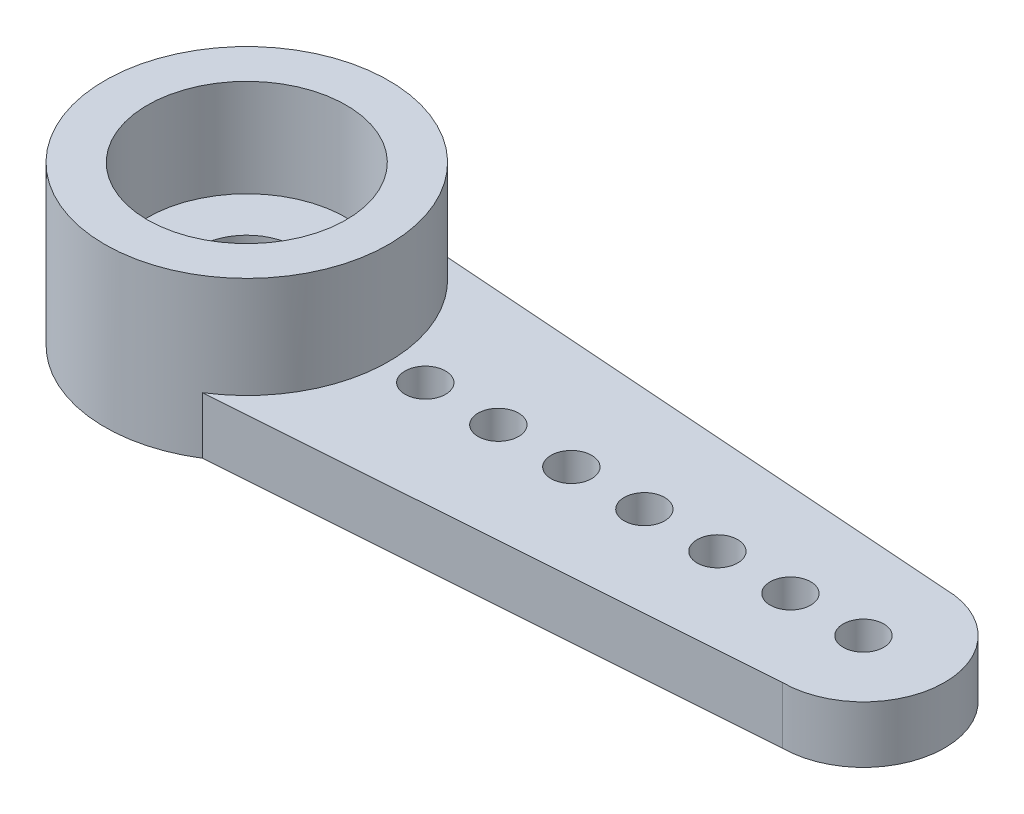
from build123d import *

# Parameters (mm, degrees)
SKETCH1_R           = 0.5
BOSS_EXTRUDE1_DEPTH = 1.4
SKETCH2_R           = 2.35
CUT_EXTRUDE1_DEPTH  = 1
SKETCH3_R           = 3.5
SKETCH3_R_2         = 2.45
BOSS_EXTRUDE2_DEPTH = 2.5
SKETCH4_R           = 1.2
CUT_EXTRUDE2_DEPTH  = 20.282440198
SKETCH5_R           = 2.45
SKETCH5_R_2         = 1.2
BOSS_EXTRUDE3_DEPTH = 0.1
SKETCH6_W           = 35.735260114
SKETCH6_H           = 17.672039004
CUT_EXTRUDE4_DEPTH  = 20.513392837
CUT_EXTRUDE5_DEPTH  = 18.980545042


with BuildPart() as part:
    # Sketch1 → Boss-Extrude1 (new body)
    with BuildSketch(Plane(origin=(0, 0, 0), x_dir=(1, 0, 0), z_dir=(0, 1, 0))):
        with BuildLine():
            Line((-15.2, 2), (-2, 2.95))
            Line((-2, 2.95), (-2, 6.35))
            ThreePointArc((-2, 6.35), (0, 8.35), (2, 6.35))
            Line((2, 6.35), (2, 3.5))
            Line((2, 3.5), (15.2, 2))
            ThreePointArc((15.2, 2), (17.2, 0), (15.2, -2))
            Line((15.2, -2), (2, -3.5))
            Line((2, -3.5), (2, -6.35))
            ThreePointArc((2, -6.35), (0, -8.35), (-2, -6.35))
            Line((-2, -6.35), (-2, -2.95))
            Line((-2, -2.95), (-15.2, -2))
            ThreePointArc((-15.2, -2), (-17.2, 0), (-15.2, 2))
        make_face()
        with Locations((0, 6.35)):
            Circle(SKETCH1_R, mode=Mode.SUBTRACT)
        with Locations((0, 4.55)):
            Circle(SKETCH1_R, mode=Mode.SUBTRACT)
        with Locations((0, -4.55)):
            Circle(SKETCH1_R, mode=Mode.SUBTRACT)
        with Locations((0, -6.35)):
            Circle(SKETCH1_R, mode=Mode.SUBTRACT)
        with Locations((-15.2, 0)):
            Circle(SKETCH1_R, mode=Mode.SUBTRACT)
        with Locations(Location((15.2, 0, 0), (0, 0, 270))):
            Circle(SKETCH1_R, mode=Mode.SUBTRACT)
        with Locations((-13.4, 0)):
            Circle(SKETCH1_R, mode=Mode.SUBTRACT)
        with Locations((-11.6, 0)):
            Circle(SKETCH1_R, mode=Mode.SUBTRACT)
        with Locations((-9.8, 0)):
            Circle(SKETCH1_R, mode=Mode.SUBTRACT)
        with Locations((-8, 0)):
            Circle(SKETCH1_R, mode=Mode.SUBTRACT)
        with Locations((-6.2, 0)):
            Circle(SKETCH1_R, mode=Mode.SUBTRACT)
        with Locations((-4.4, 0)):
            Circle(SKETCH1_R, mode=Mode.SUBTRACT)
        with Locations(Location((13.4, 0, 0), (0, 0, 270))):
            Circle(SKETCH1_R, mode=Mode.SUBTRACT)
        with Locations(Location((11.6, 0, 0), (0, 0, 270))):
            Circle(SKETCH1_R, mode=Mode.SUBTRACT)
        with Locations(Location((9.8, 0, 0), (0, 0, 270))):
            Circle(SKETCH1_R, mode=Mode.SUBTRACT)
        with Locations(Location((8, 0, 0), (0, 0, 270))):
            Circle(SKETCH1_R, mode=Mode.SUBTRACT)
        with Locations(Location((6.2, 0, 0), (0, 0, 270))):
            Circle(SKETCH1_R, mode=Mode.SUBTRACT)
        with Locations(Location((4.4, 0, 0), (0, 0, 270))):
            Circle(SKETCH1_R, mode=Mode.SUBTRACT)
    extrude(amount=BOSS_EXTRUDE1_DEPTH)

    # Sketch2 → Cut-Extrude1 (cut)
    with BuildSketch(Plane.XZ):
        with Locations(Location((0, 0, 0), (0, 0, 270))):
            Circle(SKETCH2_R)
    extrude(amount=-CUT_EXTRUDE1_DEPTH, mode=Mode.SUBTRACT)

    # Sketch3 → Boss-Extrude2 (add)
    with BuildSketch(Plane(origin=(0, 1.4, 0), x_dir=(1, 0, 0), z_dir=(0, 1, 0))):
        with Locations(Location((0, 0, 0), (0, 0, 57.731921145))):
            Circle(SKETCH3_R)
        with Locations(Location((0, 0, 0), (0, 0, 270))):
            Circle(SKETCH3_R_2, mode=Mode.SUBTRACT)
    extrude(amount=BOSS_EXTRUDE2_DEPTH)

    # Sketch4 → Cut-Extrude2 (cut, through all)
    with BuildSketch(Plane(origin=(0, 1.4, 0), x_dir=(1, 0, 0), z_dir=(0, 1, 0))):
        with Locations(Location((0, 0, 0), (0, 0, 270))):
            Circle(SKETCH4_R)
    extrude(amount=-CUT_EXTRUDE2_DEPTH, mode=Mode.SUBTRACT)

    # Sketch5 → Boss-Extrude3 (add)
    with BuildSketch(Plane(origin=(0, 1.4, 0), x_dir=(1, 0, 0), z_dir=(0, 1, 0))):
        with Locations(Location((0, 0, 0), (0, 0, 270))):
            Circle(SKETCH5_R)
        with Locations(Location((0, 0, 0), (0, 0, 270))):
            Circle(SKETCH5_R_2, mode=Mode.SUBTRACT)
    extrude(amount=BOSS_EXTRUDE3_DEPTH)

    # Sketch6 → Cut-Extrude4 (cut, through all)
    with BuildSketch(Plane.XZ):
        Rectangle(SKETCH6_W, SKETCH6_H)
        with BuildLine():
            Line((-1.868584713, -2.959457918), (-15.2, -2))
            ThreePointArc((-15.2, -2), (-17.2, 0), (-15.2, 2))
            Line((-15.2, 2), (-1.868584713, 2.959457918))
            ThreePointArc((-1.868584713, 2.959457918), (0, 3.5), (1.868584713, 2.959457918))
            Line((1.868584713, 2.959457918), (15.2, 2))
            ThreePointArc((15.2, 2), (17.2, 0), (15.2, -2))
            Line((15.2, -2), (1.868584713, -2.959457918))
            ThreePointArc((1.868584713, -2.959457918), (0, -3.5), (-1.868584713, -2.959457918))
        make_face(mode=Mode.SUBTRACT)
    extrude(amount=-CUT_EXTRUDE4_DEPTH, mode=Mode.SUBTRACT)

    # Sketch7 → Cut-Extrude5 (cut, through all)
    with BuildSketch(Plane.XZ):
        with BuildLine():
            Line((0, 3.5), (-17.731768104, 3.5))
            Line((-17.731768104, 3.5), (-17.731768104, -3.5))
            Line((-17.731768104, -3.5), (0, -3.5))
            ThreePointArc((0, -3.5), (-3.5, 0), (0, 3.5))
        make_face()
    extrude(amount=-CUT_EXTRUDE5_DEPTH, mode=Mode.SUBTRACT)


solid = part.part
